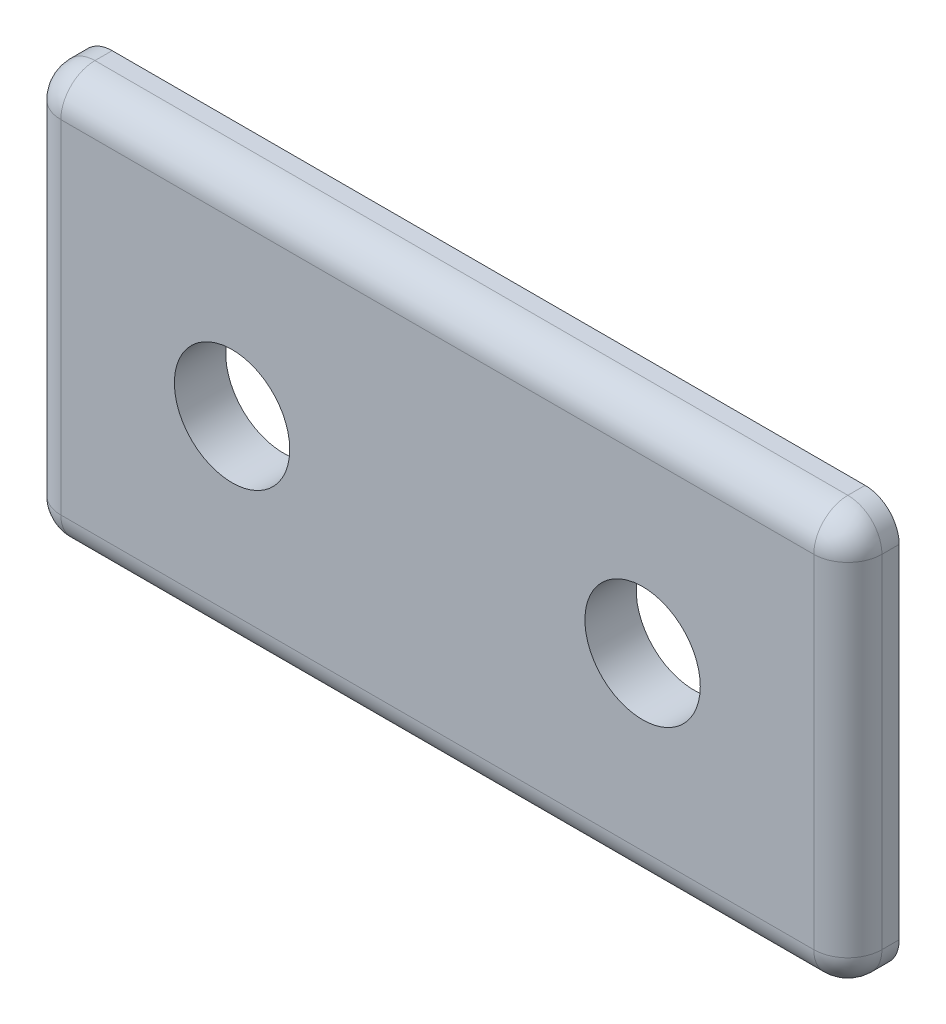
ISO-10303-21;
HEADER;
FILE_DESCRIPTION(('STEP AP214'),'2;1');
FILE_NAME('part.step','',(''),(''),'','','');
FILE_SCHEMA(('AUTOMOTIVE_DESIGN { 1 0 10303 214 1 1 1 1 }'));
ENDSEC;
DATA;
#1=APPLICATION_CONTEXT('core data for automotive mechanical design processes');
#2=APPLICATION_PROTOCOL_DEFINITION('international standard','automotive_design',2000,#1);
#3=PRODUCT_CONTEXT('',#1,'mechanical');
#4=PRODUCT('Part','Part','',(#3));
#5=PRODUCT_RELATED_PRODUCT_CATEGORY('part','',(#4));
#6=PRODUCT_DEFINITION_FORMATION('','',#4);
#7=PRODUCT_DEFINITION_CONTEXT('part definition',#1,'design');
#8=PRODUCT_DEFINITION('design','',#6,#7);
#9=PRODUCT_DEFINITION_SHAPE('','',#8);
#10=(LENGTH_UNIT() NAMED_UNIT(*) SI_UNIT(.MILLI.,.METRE.));
#11=(NAMED_UNIT(*) PLANE_ANGLE_UNIT() SI_UNIT($,.RADIAN.));
#12=(NAMED_UNIT(*) SI_UNIT($,.STERADIAN.) SOLID_ANGLE_UNIT());
#13=UNCERTAINTY_MEASURE_WITH_UNIT(LENGTH_MEASURE(1.E-05),#10,'distance_accuracy_value','');
#14=(GEOMETRIC_REPRESENTATION_CONTEXT(3) GLOBAL_UNCERTAINTY_ASSIGNED_CONTEXT((#13)) GLOBAL_UNIT_ASSIGNED_CONTEXT((#10,
#11,#12)) REPRESENTATION_CONTEXT('',''));
#15=CARTESIAN_POINT('',(0.,0.,0.));
#16=DIRECTION('',(0.,0.,1.));
#17=DIRECTION('',(1.,0.,0.));
#18=AXIS2_PLACEMENT_3D('',#15,#16,#17);
#19=CARTESIAN_POINT('',(-25.4,12.7,3.175));
#20=DIRECTION('',(1.,0.,0.));
#21=DIRECTION('',(0.,0.,-1.));
#22=AXIS2_PLACEMENT_3D('',#19,#20,#21);
#23=PLANE('',#22);
#24=DIRECTION('',(0.,-1.,0.));
#25=VECTOR('',#24,1.);
#26=CARTESIAN_POINT('',(-25.4,12.7,0.));
#27=LINE('',#26,#25);
#28=CARTESIAN_POINT('',(-25.4,10.5918,0.));
#29=VERTEX_POINT('',#28);
#30=CARTESIAN_POINT('',(-25.4,-10.5918,0.));
#31=VERTEX_POINT('',#30);
#32=EDGE_CURVE('E198',#29,#31,#27,.T.);
#33=ORIENTED_EDGE('',*,*,#32,.T.);
#34=DIRECTION('',(0.,0.,-1.));
#35=VECTOR('',#34,1.);
#36=CARTESIAN_POINT('',(-25.4,-10.5918,3.175));
#37=LINE('',#36,#35);
#38=CARTESIAN_POINT('',(-25.4,-10.5918,1.0668));
#39=VERTEX_POINT('',#38);
#40=EDGE_CURVE('E49',#31,#39,#37,.F.);
#41=ORIENTED_EDGE('',*,*,#40,.T.);
#42=DIRECTION('',(0.,-1.,0.));
#43=VECTOR('',#42,1.);
#44=CARTESIAN_POINT('',(-25.4,12.7,1.0668));
#45=LINE('',#44,#43);
#46=CARTESIAN_POINT('',(-25.4,10.5918,1.0668));
#47=VERTEX_POINT('',#46);
#48=EDGE_CURVE('E54',#39,#47,#45,.F.);
#49=ORIENTED_EDGE('',*,*,#48,.T.);
#50=DIRECTION('',(0.,0.,-1.));
#51=VECTOR('',#50,1.);
#52=CARTESIAN_POINT('',(-25.4,10.5918,3.175));
#53=LINE('',#52,#51);
#54=EDGE_CURVE('E167',#47,#29,#53,.T.);
#55=ORIENTED_EDGE('',*,*,#54,.T.);
#56=EDGE_LOOP('',(#33,#41,#49,#55));
#57=FACE_BOUND('',#56,.T.);
#58=ADVANCED_FACE('F32',(#57),#23,.F.);
#59=CARTESIAN_POINT('',(-25.4,-12.7,3.175));
#60=DIRECTION('',(0.,1.,0.));
#61=DIRECTION('',(0.,0.,1.));
#62=AXIS2_PLACEMENT_3D('',#59,#60,#61);
#63=PLANE('',#62);
#64=DIRECTION('',(1.,0.,0.));
#65=VECTOR('',#64,1.);
#66=CARTESIAN_POINT('',(-25.4,-12.7,1.0668));
#67=LINE('',#66,#65);
#68=CARTESIAN_POINT('',(23.2918,-12.7,1.0668));
#69=VERTEX_POINT('',#68);
#70=CARTESIAN_POINT('',(-23.2918,-12.7,1.0668));
#71=VERTEX_POINT('',#70);
#72=EDGE_CURVE('E163',#69,#71,#67,.F.);
#73=ORIENTED_EDGE('',*,*,#72,.T.);
#74=DIRECTION('',(0.,0.,-1.));
#75=VECTOR('',#74,1.);
#76=CARTESIAN_POINT('',(-23.2918,-12.7,3.175));
#77=LINE('',#76,#75);
#78=CARTESIAN_POINT('',(-23.2918,-12.7,0.));
#79=VERTEX_POINT('',#78);
#80=EDGE_CURVE('E165',#71,#79,#77,.T.);
#81=ORIENTED_EDGE('',*,*,#80,.T.);
#82=DIRECTION('',(1.,0.,0.));
#83=VECTOR('',#82,1.);
#84=CARTESIAN_POINT('',(-25.4,-12.7,0.));
#85=LINE('',#84,#83);
#86=CARTESIAN_POINT('',(23.2918,-12.7,0.));
#87=VERTEX_POINT('',#86);
#88=EDGE_CURVE('E200',#79,#87,#85,.T.);
#89=ORIENTED_EDGE('',*,*,#88,.T.);
#90=DIRECTION('',(0.,0.,-1.));
#91=VECTOR('',#90,1.);
#92=CARTESIAN_POINT('',(23.2918,-12.7,3.175));
#93=LINE('',#92,#91);
#94=EDGE_CURVE('E161',#87,#69,#93,.F.);
#95=ORIENTED_EDGE('',*,*,#94,.T.);
#96=EDGE_LOOP('',(#73,#81,#89,#95));
#97=FACE_BOUND('',#96,.T.);
#98=ADVANCED_FACE('F254',(#97),#63,.F.);
#99=CARTESIAN_POINT('',(25.4,12.7,3.175));
#100=DIRECTION('',(-1.,0.,0.));
#101=DIRECTION('',(0.,0.,1.));
#102=AXIS2_PLACEMENT_3D('',#99,#100,#101);
#103=PLANE('',#102);
#104=DIRECTION('',(0.,1.,0.));
#105=VECTOR('',#104,1.);
#106=CARTESIAN_POINT('',(25.4,-12.7,1.0668));
#107=LINE('',#106,#105);
#108=CARTESIAN_POINT('',(25.4,10.5918,1.0668));
#109=VERTEX_POINT('',#108);
#110=CARTESIAN_POINT('',(25.4,-10.5918,1.0668));
#111=VERTEX_POINT('',#110);
#112=EDGE_CURVE('E157',#109,#111,#107,.F.);
#113=ORIENTED_EDGE('',*,*,#112,.T.);
#114=DIRECTION('',(0.,0.,-1.));
#115=VECTOR('',#114,1.);
#116=CARTESIAN_POINT('',(25.4,-10.5918,3.175));
#117=LINE('',#116,#115);
#118=CARTESIAN_POINT('',(25.4,-10.5918,0.));
#119=VERTEX_POINT('',#118);
#120=EDGE_CURVE('E159',#111,#119,#117,.T.);
#121=ORIENTED_EDGE('',*,*,#120,.T.);
#122=DIRECTION('',(0.,1.,0.));
#123=VECTOR('',#122,1.);
#124=CARTESIAN_POINT('',(25.4,12.7,0.));
#125=LINE('',#124,#123);
#126=CARTESIAN_POINT('',(25.4,10.5918,0.));
#127=VERTEX_POINT('',#126);
#128=EDGE_CURVE('E204',#119,#127,#125,.T.);
#129=ORIENTED_EDGE('',*,*,#128,.T.);
#130=DIRECTION('',(0.,0.,-1.));
#131=VECTOR('',#130,1.);
#132=CARTESIAN_POINT('',(25.4,10.5918,3.175));
#133=LINE('',#132,#131);
#134=EDGE_CURVE('E155',#127,#109,#133,.F.);
#135=ORIENTED_EDGE('',*,*,#134,.T.);
#136=EDGE_LOOP('',(#113,#121,#129,#135));
#137=FACE_BOUND('',#136,.T.);
#138=ADVANCED_FACE('F259',(#137),#103,.F.);
#139=CARTESIAN_POINT('',(-25.4,12.7,3.175));
#140=DIRECTION('',(0.,-1.,0.));
#141=DIRECTION('',(1.,0.,0.));
#142=AXIS2_PLACEMENT_3D('',#139,#140,#141);
#143=PLANE('',#142);
#144=DIRECTION('',(-1.,0.,0.));
#145=VECTOR('',#144,1.);
#146=CARTESIAN_POINT('',(25.4,12.7,1.0668));
#147=LINE('',#146,#145);
#148=CARTESIAN_POINT('',(-23.2918,12.7,1.0668));
#149=VERTEX_POINT('',#148);
#150=CARTESIAN_POINT('',(23.2918,12.7,1.0668));
#151=VERTEX_POINT('',#150);
#152=EDGE_CURVE('E117',#149,#151,#147,.F.);
#153=ORIENTED_EDGE('',*,*,#152,.T.);
#154=DIRECTION('',(0.,0.,-1.));
#155=VECTOR('',#154,1.);
#156=CARTESIAN_POINT('',(23.2918,12.7,3.175));
#157=LINE('',#156,#155);
#158=CARTESIAN_POINT('',(23.2918,12.7,0.));
#159=VERTEX_POINT('',#158);
#160=EDGE_CURVE('E153',#151,#159,#157,.T.);
#161=ORIENTED_EDGE('',*,*,#160,.T.);
#162=DIRECTION('',(-1.,0.,0.));
#163=VECTOR('',#162,1.);
#164=CARTESIAN_POINT('',(-25.4,12.7,0.));
#165=LINE('',#164,#163);
#166=CARTESIAN_POINT('',(-23.2918,12.7,0.));
#167=VERTEX_POINT('',#166);
#168=EDGE_CURVE('E140',#159,#167,#165,.T.);
#169=ORIENTED_EDGE('',*,*,#168,.T.);
#170=DIRECTION('',(0.,0.,-1.));
#171=VECTOR('',#170,1.);
#172=CARTESIAN_POINT('',(-23.2918,12.7,3.175));
#173=LINE('',#172,#171);
#174=EDGE_CURVE('E146',#167,#149,#173,.F.);
#175=ORIENTED_EDGE('',*,*,#174,.T.);
#176=EDGE_LOOP('',(#153,#161,#169,#175));
#177=FACE_BOUND('',#176,.T.);
#178=ADVANCED_FACE('F231',(#177),#143,.F.);
#179=CARTESIAN_POINT('',(-25.4,-12.7,3.175));
#180=DIRECTION('',(0.,0.,1.));
#181=DIRECTION('',(1.,0.,0.));
#182=AXIS2_PLACEMENT_3D('',#179,#180,#181);
#183=PLANE('',#182);
#184=CARTESIAN_POINT('',(-12.7,0.,3.175));
#185=DIRECTION('',(0.,0.,1.));
#186=DIRECTION('',(1.,0.,0.));
#187=AXIS2_PLACEMENT_3D('',#184,#185,#186);
#188=CIRCLE('',#187,3.5687);
#189=CARTESIAN_POINT('',(-9.1313,0.,3.175));
#190=VERTEX_POINT('',#189);
#191=EDGE_CURVE('E421',#190,#190,#188,.T.);
#192=ORIENTED_EDGE('',*,*,#191,.F.);
#193=EDGE_LOOP('',(#192));
#194=FACE_BOUND('',#193,.T.);
#195=CARTESIAN_POINT('',(12.7,0.,3.175));
#196=DIRECTION('',(0.,0.,1.));
#197=DIRECTION('',(1.,0.,0.));
#198=AXIS2_PLACEMENT_3D('',#195,#196,#197);
#199=CIRCLE('',#198,3.5687);
#200=CARTESIAN_POINT('',(16.2687,0.,3.175));
#201=VERTEX_POINT('',#200);
#202=EDGE_CURVE('E424',#201,#201,#199,.T.);
#203=ORIENTED_EDGE('',*,*,#202,.F.);
#204=EDGE_LOOP('',(#203));
#205=FACE_BOUND('',#204,.T.);
#206=DIRECTION('',(0.,1.,0.));
#207=VECTOR('',#206,1.);
#208=CARTESIAN_POINT('',(23.2918,12.7,3.175));
#209=LINE('',#208,#207);
#210=CARTESIAN_POINT('',(23.2918,-10.5918,3.175));
#211=VERTEX_POINT('',#210);
#212=CARTESIAN_POINT('',(23.2918,10.5918,3.175));
#213=VERTEX_POINT('',#212);
#214=EDGE_CURVE('E144',#211,#213,#209,.T.);
#215=ORIENTED_EDGE('',*,*,#214,.T.);
#216=DIRECTION('',(-1.,0.,0.));
#217=VECTOR('',#216,1.);
#218=CARTESIAN_POINT('',(-25.4,10.5918,3.175));
#219=LINE('',#218,#217);
#220=CARTESIAN_POINT('',(-23.2918,10.5918,3.175));
#221=VERTEX_POINT('',#220);
#222=EDGE_CURVE('E115',#213,#221,#219,.T.);
#223=ORIENTED_EDGE('',*,*,#222,.T.);
#224=DIRECTION('',(0.,-1.,0.));
#225=VECTOR('',#224,1.);
#226=CARTESIAN_POINT('',(-23.2918,-12.7,3.175));
#227=LINE('',#226,#225);
#228=CARTESIAN_POINT('',(-23.2918,-10.5918,3.175));
#229=VERTEX_POINT('',#228);
#230=EDGE_CURVE('E133',#221,#229,#227,.T.);
#231=ORIENTED_EDGE('',*,*,#230,.T.);
#232=DIRECTION('',(1.,0.,0.));
#233=VECTOR('',#232,1.);
#234=CARTESIAN_POINT('',(25.4,-10.5918,3.175));
#235=LINE('',#234,#233);
#236=EDGE_CURVE('E139',#229,#211,#235,.T.);
#237=ORIENTED_EDGE('',*,*,#236,.T.);
#238=EDGE_LOOP('',(#215,#223,#231,#237));
#239=FACE_BOUND('',#238,.T.);
#240=ADVANCED_FACE('F142',(#194,#205,#239),#183,.T.);
#241=CARTESIAN_POINT('',(-25.4,-12.7,0.));
#242=DIRECTION('',(0.,0.,1.));
#243=DIRECTION('',(1.,0.,0.));
#244=AXIS2_PLACEMENT_3D('',#241,#242,#243);
#245=PLANE('',#244);
#246=CARTESIAN_POINT('',(-12.7,0.,0.));
#247=DIRECTION('',(0.,0.,1.));
#248=DIRECTION('',(1.,0.,0.));
#249=AXIS2_PLACEMENT_3D('',#246,#247,#248);
#250=CIRCLE('',#249,3.5687);
#251=CARTESIAN_POINT('',(-9.1313,0.,0.));
#252=VERTEX_POINT('',#251);
#253=EDGE_CURVE('E425',#252,#252,#250,.F.);
#254=ORIENTED_EDGE('',*,*,#253,.F.);
#255=EDGE_LOOP('',(#254));
#256=FACE_BOUND('',#255,.T.);
#257=CARTESIAN_POINT('',(12.7,0.,0.));
#258=DIRECTION('',(0.,0.,1.));
#259=DIRECTION('',(1.,0.,0.));
#260=AXIS2_PLACEMENT_3D('',#257,#258,#259);
#261=CIRCLE('',#260,3.5687);
#262=CARTESIAN_POINT('',(16.2687,0.,0.));
#263=VERTEX_POINT('',#262);
#264=EDGE_CURVE('E121',#263,#263,#261,.F.);
#265=ORIENTED_EDGE('',*,*,#264,.F.);
#266=EDGE_LOOP('',(#265));
#267=FACE_BOUND('',#266,.T.);
#268=ORIENTED_EDGE('',*,*,#88,.F.);
#269=CARTESIAN_POINT('',(-23.2918,-10.5918,0.));
#270=DIRECTION('',(0.,0.,1.));
#271=DIRECTION('',(1.,0.,0.));
#272=AXIS2_PLACEMENT_3D('',#269,#270,#271);
#273=CIRCLE('',#272,2.1082);
#274=EDGE_CURVE('E11',#79,#31,#273,.F.);
#275=ORIENTED_EDGE('',*,*,#274,.T.);
#276=ORIENTED_EDGE('',*,*,#32,.F.);
#277=CARTESIAN_POINT('',(-23.2918,10.5918,0.));
#278=DIRECTION('',(0.,0.,1.));
#279=DIRECTION('',(1.,0.,0.));
#280=AXIS2_PLACEMENT_3D('',#277,#278,#279);
#281=CIRCLE('',#280,2.1082);
#282=EDGE_CURVE('E171',#29,#167,#281,.F.);
#283=ORIENTED_EDGE('',*,*,#282,.T.);
#284=ORIENTED_EDGE('',*,*,#168,.F.);
#285=CARTESIAN_POINT('',(23.2918,10.5918,0.));
#286=DIRECTION('',(0.,0.,1.));
#287=DIRECTION('',(1.,0.,0.));
#288=AXIS2_PLACEMENT_3D('',#285,#286,#287);
#289=CIRCLE('',#288,2.1082);
#290=EDGE_CURVE('E173',#159,#127,#289,.F.);
#291=ORIENTED_EDGE('',*,*,#290,.T.);
#292=ORIENTED_EDGE('',*,*,#128,.F.);
#293=CARTESIAN_POINT('',(23.2918,-10.5918,0.));
#294=DIRECTION('',(0.,0.,1.));
#295=DIRECTION('',(1.,0.,0.));
#296=AXIS2_PLACEMENT_3D('',#293,#294,#295);
#297=CIRCLE('',#296,2.1082);
#298=EDGE_CURVE('E41',#119,#87,#297,.F.);
#299=ORIENTED_EDGE('',*,*,#298,.T.);
#300=EDGE_LOOP('',(#268,#275,#276,#283,#284,#291,#292,#299));
#301=FACE_BOUND('',#300,.T.);
#302=ADVANCED_FACE('F238',(#256,#267,#301),#245,.F.);
#303=CARTESIAN_POINT('',(23.2918,-10.5918,3.175));
#304=DIRECTION('',(0.,0.,-1.));
#305=DIRECTION('',(-1.,0.,0.));
#306=AXIS2_PLACEMENT_3D('',#303,#304,#305);
#307=CYLINDRICAL_SURFACE('',#306,2.1082);
#308=ORIENTED_EDGE('',*,*,#298,.F.);
#309=ORIENTED_EDGE('',*,*,#120,.F.);
#310=CARTESIAN_POINT('',(23.2918,-10.5918,1.0668));
#311=DIRECTION('',(0.,0.,1.));
#312=DIRECTION('',(1.,0.,0.));
#313=AXIS2_PLACEMENT_3D('',#310,#311,#312);
#314=CIRCLE('',#313,2.1082);
#315=EDGE_CURVE('E36',#69,#111,#314,.T.);
#316=ORIENTED_EDGE('',*,*,#315,.F.);
#317=ORIENTED_EDGE('',*,*,#94,.F.);
#318=EDGE_LOOP('',(#308,#309,#316,#317));
#319=FACE_BOUND('',#318,.T.);
#320=ADVANCED_FACE('F34',(#319),#307,.T.);
#321=CARTESIAN_POINT('',(-25.4,-10.5918,1.0668));
#322=DIRECTION('',(-1.,0.,0.));
#323=DIRECTION('',(0.,0.,1.));
#324=AXIS2_PLACEMENT_3D('',#321,#322,#323);
#325=CYLINDRICAL_SURFACE('',#324,2.1082);
#326=CARTESIAN_POINT('',(-23.2918,-10.5918,1.0668));
#327=DIRECTION('',(-1.,0.,0.));
#328=DIRECTION('',(0.,0.,1.));
#329=AXIS2_PLACEMENT_3D('',#326,#327,#328);
#330=CIRCLE('',#329,2.1082);
#331=EDGE_CURVE('E190',#71,#229,#330,.T.);
#332=ORIENTED_EDGE('',*,*,#331,.F.);
#333=ORIENTED_EDGE('',*,*,#72,.F.);
#334=CARTESIAN_POINT('',(23.2918,-10.5918,1.0668));
#335=DIRECTION('',(1.,0.,0.));
#336=DIRECTION('',(0.,1.,0.));
#337=AXIS2_PLACEMENT_3D('',#334,#335,#336);
#338=CIRCLE('',#337,2.1082);
#339=EDGE_CURVE('E192',#211,#69,#338,.T.);
#340=ORIENTED_EDGE('',*,*,#339,.F.);
#341=ORIENTED_EDGE('',*,*,#236,.F.);
#342=EDGE_LOOP('',(#332,#333,#340,#341));
#343=FACE_BOUND('',#342,.T.);
#344=ADVANCED_FACE('F215',(#343),#325,.T.);
#345=CARTESIAN_POINT('',(-23.2918,-10.5918,3.175));
#346=DIRECTION('',(0.,0.,-1.));
#347=DIRECTION('',(-1.,0.,0.));
#348=AXIS2_PLACEMENT_3D('',#345,#346,#347);
#349=CYLINDRICAL_SURFACE('',#348,2.1082);
#350=ORIENTED_EDGE('',*,*,#274,.F.);
#351=ORIENTED_EDGE('',*,*,#80,.F.);
#352=CARTESIAN_POINT('',(-23.2918,-10.5918,1.0668));
#353=DIRECTION('',(0.,0.,1.));
#354=DIRECTION('',(1.,0.,0.));
#355=AXIS2_PLACEMENT_3D('',#352,#353,#354);
#356=CIRCLE('',#355,2.1082);
#357=EDGE_CURVE('E187',#39,#71,#356,.T.);
#358=ORIENTED_EDGE('',*,*,#357,.F.);
#359=ORIENTED_EDGE('',*,*,#40,.F.);
#360=EDGE_LOOP('',(#350,#351,#358,#359));
#361=FACE_BOUND('',#360,.T.);
#362=ADVANCED_FACE('F242',(#361),#349,.T.);
#363=CARTESIAN_POINT('',(23.2918,-10.5918,1.0668));
#364=DIRECTION('',(0.,0.,1.));
#365=DIRECTION('',(1.,0.,0.));
#366=AXIS2_PLACEMENT_3D('',#363,#364,#365);
#367=SPHERICAL_SURFACE('',#366,2.1082);
#368=ORIENTED_EDGE('',*,*,#339,.T.);
#369=ORIENTED_EDGE('',*,*,#315,.T.);
#370=CARTESIAN_POINT('',(23.2918,-10.5918,1.0668));
#371=DIRECTION('',(0.,-1.,0.));
#372=DIRECTION('',(0.,0.,-1.));
#373=AXIS2_PLACEMENT_3D('',#370,#371,#372);
#374=CIRCLE('',#373,2.1082);
#375=EDGE_CURVE('E184',#211,#111,#374,.F.);
#376=ORIENTED_EDGE('',*,*,#375,.F.);
#377=EDGE_LOOP('',(#368,#369,#376));
#378=FACE_BOUND('',#377,.T.);
#379=ADVANCED_FACE('F216',(#378),#367,.T.);
#380=CARTESIAN_POINT('',(-23.2918,-10.5918,1.0668));
#381=DIRECTION('',(0.,0.,1.));
#382=DIRECTION('',(1.,0.,0.));
#383=AXIS2_PLACEMENT_3D('',#380,#381,#382);
#384=SPHERICAL_SURFACE('',#383,2.1082);
#385=ORIENTED_EDGE('',*,*,#357,.T.);
#386=ORIENTED_EDGE('',*,*,#331,.T.);
#387=CARTESIAN_POINT('',(-23.2918,-10.5918,1.0668));
#388=DIRECTION('',(0.,-1.,0.));
#389=DIRECTION('',(0.,0.,-1.));
#390=AXIS2_PLACEMENT_3D('',#387,#388,#389);
#391=CIRCLE('',#390,2.1082);
#392=EDGE_CURVE('E136',#39,#229,#391,.F.);
#393=ORIENTED_EDGE('',*,*,#392,.F.);
#394=EDGE_LOOP('',(#385,#386,#393));
#395=FACE_BOUND('',#394,.T.);
#396=ADVANCED_FACE('F244',(#395),#384,.T.);
#397=CARTESIAN_POINT('',(23.2918,10.5918,3.175));
#398=DIRECTION('',(0.,0.,-1.));
#399=DIRECTION('',(-1.,0.,0.));
#400=AXIS2_PLACEMENT_3D('',#397,#398,#399);
#401=CYLINDRICAL_SURFACE('',#400,2.1082);
#402=ORIENTED_EDGE('',*,*,#290,.F.);
#403=ORIENTED_EDGE('',*,*,#160,.F.);
#404=CARTESIAN_POINT('',(23.2918,10.5918,1.0668));
#405=DIRECTION('',(0.,0.,1.));
#406=DIRECTION('',(1.,0.,0.));
#407=AXIS2_PLACEMENT_3D('',#404,#405,#406);
#408=CIRCLE('',#407,2.1082);
#409=EDGE_CURVE('E180',#109,#151,#408,.T.);
#410=ORIENTED_EDGE('',*,*,#409,.F.);
#411=ORIENTED_EDGE('',*,*,#134,.F.);
#412=EDGE_LOOP('',(#402,#403,#410,#411));
#413=FACE_BOUND('',#412,.T.);
#414=ADVANCED_FACE('F228',(#413),#401,.T.);
#415=CARTESIAN_POINT('',(23.2918,-12.7,1.0668));
#416=DIRECTION('',(0.,-1.,0.));
#417=DIRECTION('',(0.,0.,-1.));
#418=AXIS2_PLACEMENT_3D('',#415,#416,#417);
#419=CYLINDRICAL_SURFACE('',#418,2.1082);
#420=ORIENTED_EDGE('',*,*,#375,.T.);
#421=ORIENTED_EDGE('',*,*,#112,.F.);
#422=CARTESIAN_POINT('',(23.2918,10.5918,1.0668));
#423=DIRECTION('',(0.,1.,0.));
#424=DIRECTION('',(0.,0.,1.));
#425=AXIS2_PLACEMENT_3D('',#422,#423,#424);
#426=CIRCLE('',#425,2.1082);
#427=EDGE_CURVE('E130',#213,#109,#426,.T.);
#428=ORIENTED_EDGE('',*,*,#427,.F.);
#429=ORIENTED_EDGE('',*,*,#214,.F.);
#430=EDGE_LOOP('',(#420,#421,#428,#429));
#431=FACE_BOUND('',#430,.T.);
#432=ADVANCED_FACE('F219',(#431),#419,.T.);
#433=CARTESIAN_POINT('',(-23.2918,-12.7,1.0668));
#434=DIRECTION('',(0.,1.,0.));
#435=DIRECTION('',(0.,0.,1.));
#436=AXIS2_PLACEMENT_3D('',#433,#434,#435);
#437=CYLINDRICAL_SURFACE('',#436,2.1082);
#438=ORIENTED_EDGE('',*,*,#392,.T.);
#439=ORIENTED_EDGE('',*,*,#230,.F.);
#440=CARTESIAN_POINT('',(-23.2918,10.5918,1.0668));
#441=DIRECTION('',(0.,1.,0.));
#442=DIRECTION('',(0.,0.,1.));
#443=AXIS2_PLACEMENT_3D('',#440,#441,#442);
#444=CIRCLE('',#443,2.1082);
#445=EDGE_CURVE('E124',#47,#221,#444,.T.);
#446=ORIENTED_EDGE('',*,*,#445,.F.);
#447=ORIENTED_EDGE('',*,*,#48,.F.);
#448=EDGE_LOOP('',(#438,#439,#446,#447));
#449=FACE_BOUND('',#448,.T.);
#450=ADVANCED_FACE('F134',(#449),#437,.T.);
#451=CARTESIAN_POINT('',(-23.2918,10.5918,3.175));
#452=DIRECTION('',(0.,0.,-1.));
#453=DIRECTION('',(-1.,0.,0.));
#454=AXIS2_PLACEMENT_3D('',#451,#452,#453);
#455=CYLINDRICAL_SURFACE('',#454,2.1082);
#456=ORIENTED_EDGE('',*,*,#282,.F.);
#457=ORIENTED_EDGE('',*,*,#54,.F.);
#458=CARTESIAN_POINT('',(-23.2918,10.5918,1.0668));
#459=DIRECTION('',(0.,0.,1.));
#460=DIRECTION('',(1.,0.,0.));
#461=AXIS2_PLACEMENT_3D('',#458,#459,#460);
#462=CIRCLE('',#461,2.1082);
#463=EDGE_CURVE('E128',#149,#47,#462,.T.);
#464=ORIENTED_EDGE('',*,*,#463,.F.);
#465=ORIENTED_EDGE('',*,*,#174,.F.);
#466=EDGE_LOOP('',(#456,#457,#464,#465));
#467=FACE_BOUND('',#466,.T.);
#468=ADVANCED_FACE('F235',(#467),#455,.T.);
#469=CARTESIAN_POINT('',(23.2918,10.5918,1.0668));
#470=DIRECTION('',(0.,0.,1.));
#471=DIRECTION('',(1.,0.,0.));
#472=AXIS2_PLACEMENT_3D('',#469,#470,#471);
#473=SPHERICAL_SURFACE('',#472,2.1082);
#474=ORIENTED_EDGE('',*,*,#427,.T.);
#475=ORIENTED_EDGE('',*,*,#409,.T.);
#476=CARTESIAN_POINT('',(23.2918,10.5918,1.0668));
#477=DIRECTION('',(1.,0.,0.));
#478=DIRECTION('',(0.,0.,-1.));
#479=AXIS2_PLACEMENT_3D('',#476,#477,#478);
#480=CIRCLE('',#479,2.1082);
#481=EDGE_CURVE('E120',#213,#151,#480,.F.);
#482=ORIENTED_EDGE('',*,*,#481,.F.);
#483=EDGE_LOOP('',(#474,#475,#482));
#484=FACE_BOUND('',#483,.T.);
#485=ADVANCED_FACE('F223',(#484),#473,.T.);
#486=CARTESIAN_POINT('',(-23.2918,10.5918,1.0668));
#487=DIRECTION('',(0.,0.,1.));
#488=DIRECTION('',(1.,0.,0.));
#489=AXIS2_PLACEMENT_3D('',#486,#487,#488);
#490=SPHERICAL_SURFACE('',#489,2.1082);
#491=ORIENTED_EDGE('',*,*,#463,.T.);
#492=ORIENTED_EDGE('',*,*,#445,.T.);
#493=CARTESIAN_POINT('',(-23.2918,10.5918,1.0668));
#494=DIRECTION('',(-1.,0.,0.));
#495=DIRECTION('',(0.,0.,1.));
#496=AXIS2_PLACEMENT_3D('',#493,#494,#495);
#497=CIRCLE('',#496,2.1082);
#498=EDGE_CURVE('E111',#149,#221,#497,.F.);
#499=ORIENTED_EDGE('',*,*,#498,.F.);
#500=EDGE_LOOP('',(#491,#492,#499));
#501=FACE_BOUND('',#500,.T.);
#502=ADVANCED_FACE('F126',(#501),#490,.T.);
#503=CARTESIAN_POINT('',(-25.4,10.5918,1.0668));
#504=DIRECTION('',(1.,0.,0.));
#505=DIRECTION('',(0.,1.,0.));
#506=AXIS2_PLACEMENT_3D('',#503,#504,#505);
#507=CYLINDRICAL_SURFACE('',#506,2.1082);
#508=ORIENTED_EDGE('',*,*,#481,.T.);
#509=ORIENTED_EDGE('',*,*,#152,.F.);
#510=ORIENTED_EDGE('',*,*,#498,.T.);
#511=ORIENTED_EDGE('',*,*,#222,.F.);
#512=EDGE_LOOP('',(#508,#509,#510,#511));
#513=FACE_BOUND('',#512,.T.);
#514=ADVANCED_FACE('F113',(#513),#507,.T.);
#515=CARTESIAN_POINT('',(12.7,0.,-0.00100000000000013));
#516=DIRECTION('',(0.,0.,1.));
#517=DIRECTION('',(1.,0.,0.));
#518=AXIS2_PLACEMENT_3D('',#515,#516,#517);
#519=CYLINDRICAL_SURFACE('',#518,3.5687);
#520=ORIENTED_EDGE('',*,*,#202,.T.);
#521=EDGE_LOOP('',(#520));
#522=FACE_BOUND('',#521,.T.);
#523=ORIENTED_EDGE('',*,*,#264,.T.);
#524=EDGE_LOOP('',(#523));
#525=FACE_BOUND('',#524,.T.);
#526=ADVANCED_FACE('F266',(#522,#525),#519,.F.);
#527=CARTESIAN_POINT('',(-12.7,0.,-0.00100000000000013));
#528=DIRECTION('',(0.,0.,1.));
#529=DIRECTION('',(1.,0.,0.));
#530=AXIS2_PLACEMENT_3D('',#527,#528,#529);
#531=CYLINDRICAL_SURFACE('',#530,3.5687);
#532=ORIENTED_EDGE('',*,*,#191,.T.);
#533=EDGE_LOOP('',(#532));
#534=FACE_BOUND('',#533,.T.);
#535=ORIENTED_EDGE('',*,*,#253,.T.);
#536=EDGE_LOOP('',(#535));
#537=FACE_BOUND('',#536,.T.);
#538=ADVANCED_FACE('F307',(#534,#537),#531,.F.);
#539=CLOSED_SHELL('',(#58,#98,#138,#178,#240,#302,#320,#344,#362,#379,#396,#414,#432,#450,#468,
#485,#502,#514,#526,#538));
#540=MANIFOLD_SOLID_BREP('B2',#539);
#541=ADVANCED_BREP_SHAPE_REPRESENTATION('',(#18,#540),#14);
#542=SHAPE_DEFINITION_REPRESENTATION(#9,#541);
ENDSEC;
END-ISO-10303-21;
